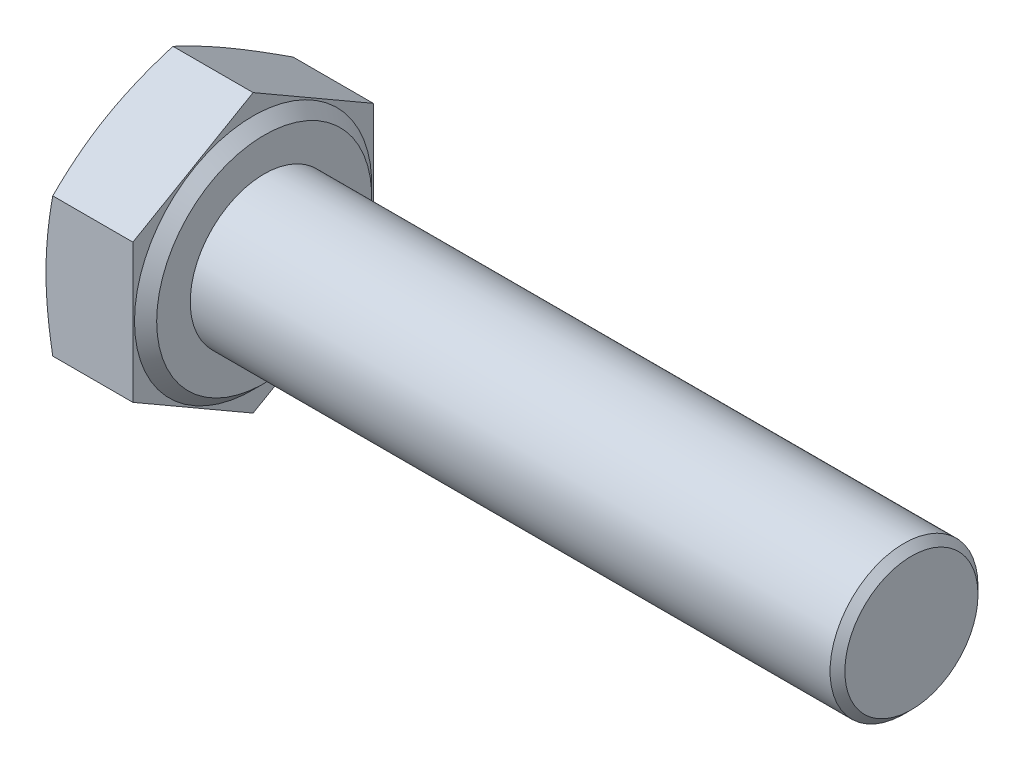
from build123d import *

# Parameters (mm, degrees)
BASEHEAD_DEPTH = 5.3
SKETCH5_R      = 4
BASEBODY_DEPTH = 35
CHAMFER1_SIZE  = 0.4


with BuildPart() as part:
    # Sketch2 → BaseHead (new body)
    with BuildSketch(Plane(origin=(0, 0, 0), x_dir=(0, 0, -1), z_dir=(1, 0, 0))):
        Polygon((0, -7.505553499), (6.5, -3.75277675), (6.5, 3.75277675), (0, 7.505553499), (-6.5, 3.75277675), (-6.5, -3.75277675), align=None)
    extrude(amount=BASEHEAD_DEPTH)

    # Sketch3 → BearingFace (revolve, cut)
    with BuildSketch(Plane.XY, mode=Mode.PRIVATE) as bearingface_sk:
        Polygon((5.3, 7.505553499), (5.3, 5.815), (4.7, 6.415), (4.7, 7.505553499), align=None)
    revolve(bearingface_sk.sketch.rotate(Axis((-0.957090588, 0, 0), (1, 0, 0)), 90), axis=Axis((-0.957090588, 0, 0), (1, 0, 0)), mode=Mode.SUBTRACT)

    # Sketch4 → HeadChamfer (revolve, cut)
    with BuildSketch(Plane.XY):
        Polygon((0, 7.505553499), (0.365991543, 7.505553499), (0, 6.5), align=None)
    revolve(axis=Axis((-0.493528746, 0, 0), (1, 0, 0)), mode=Mode.SUBTRACT)

    # Sketch5 → BaseBody (add)
    with BuildSketch(Plane(origin=(5.3, 0, 0), x_dir=(0, 0, -1), z_dir=(1, 0, 0))):
        Circle(SKETCH5_R)
    extrude(amount=BASEBODY_DEPTH)

    # Chamfer1
    chamfer1_edges = [part.edges().sort_by_distance(p)[0] for p in [
        (40.3, 0, 4),
    ]]
    chamfer(chamfer1_edges, length=CHAMFER1_SIZE)


solid = part.part
